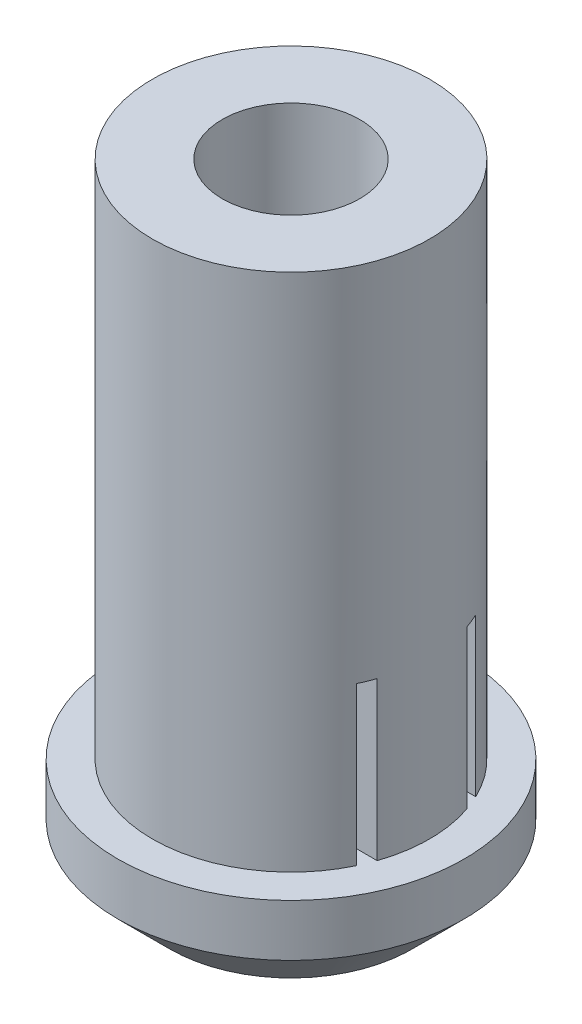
from build123d import *

# Parameters (mm, degrees)
SKETCH_2_R               = 5
EXTRUDE_1_DEPTH          = 18
SKETCH_3_OUTSIDE_W       = 16.578
SKETCH_3_OUTSIDE_H       = 16.578
SKETCH_3_OUTSIDE_R       = 4
CUT_EXTRUDE_1_DEPTH      = 15
SKETCH_4_R               = 2.18459521
CUT_EXTRUDE_2_DEPTH      = 0.1
SKETCH_5_R               = 1.98444167
CUT_EXTRUDE_3_DEPTH      = 6
CUT_EXTRUDE_4_DEPTH      = 6
CUT_EXTRUDE_4_DEPTH_BACK = 6
SKETCH_6_W               = 0.427903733
SKETCH_6_H               = 4.551816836
CHAMFER_1_SIZE           = 1.5


with BuildPart() as part:
    # Sketch 2 → Extrude 1 (new body)
    with BuildSketch(Plane(origin=(0, 0, 0), x_dir=(1, 0, 0), z_dir=(0, 1, 0))):
        with Locations(Location((0, 0, 0), (0, 0, 270))):
            Circle(SKETCH_2_R)
    extrude(amount=EXTRUDE_1_DEPTH)

    # Sketch 3 outside → Cut-Extrude 1 (cut)
    with BuildSketch(Plane(origin=(0, 18, 0), x_dir=(1, 0, 0), z_dir=(0, 1, 0))):
        Rectangle(SKETCH_3_OUTSIDE_W, SKETCH_3_OUTSIDE_H)
        with Locations(Location((0, 0, 0), (0, 0, 270))):
            Circle(SKETCH_3_OUTSIDE_R, mode=Mode.SUBTRACT)
    extrude(amount=-CUT_EXTRUDE_1_DEPTH, mode=Mode.SUBTRACT)

    # Sketch 4 → Cut-Extrude 2 (cut)
    with BuildSketch(Plane.XZ):
        with Locations(Location((0, 0, 0), (0, 0, 270))):
            Circle(SKETCH_4_R)
    extrude(amount=-CUT_EXTRUDE_2_DEPTH, mode=Mode.SUBTRACT)

    # Sketch 5 → Cut-Extrude 3 (cut)
    with BuildSketch(Plane(origin=(0, 18, 0), x_dir=(1, 0, 0), z_dir=(0, 1, 0))):
        with Locations(Location((0, 0, 0), (0, 0, 270))):
            Circle(SKETCH_5_R)
    extrude(amount=-CUT_EXTRUDE_3_DEPTH, mode=Mode.SUBTRACT)

    # Sketch 6 → Cut-Extrude 4 (cut, two sides: drawn at the far end of the back side and taken through both)
    with BuildSketch(Plane(origin=(0, 0, 0), x_dir=(0, 0, -1), z_dir=(1, 0, 0)).offset(-CUT_EXTRUDE_4_DEPTH_BACK)):
        with Locations((-1.510248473, 5.275908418)):
            Rectangle(SKETCH_6_W, SKETCH_6_H)
        with Locations((1.510248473, 5.275908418)):
            Rectangle(SKETCH_6_W, SKETCH_6_H)
    extrude(amount=CUT_EXTRUDE_4_DEPTH + CUT_EXTRUDE_4_DEPTH_BACK, mode=Mode.SUBTRACT)

    # Chamfer 1
    chamfer_1_edges = [part.edges().sort_by_distance(p)[0] for p in [
        (0, 0, -5),
    ]]
    chamfer(chamfer_1_edges, length=CHAMFER_1_SIZE)


solid = part.part
